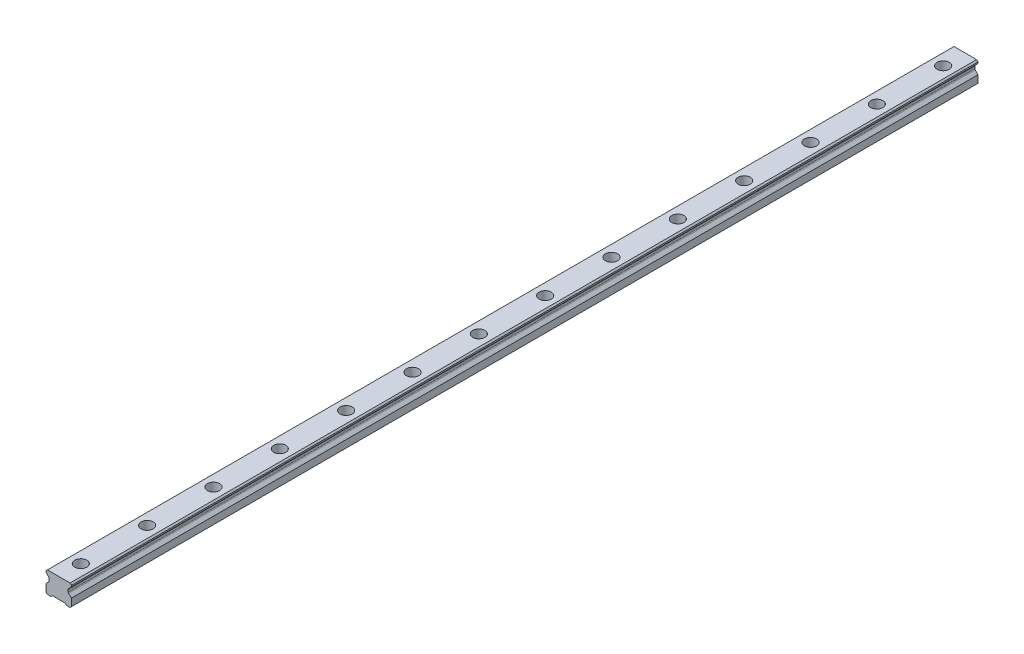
from build123d import *

# Parameters (mm, degrees)
SKETCH1_W           = 23
SKETCH1_H           = 19.2
BOSS_EXTRUDE1_DEPTH = 410
CUT_EXTRUDE1_DEPTH  = 821.305363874
CHAMFER1_SIZE       = 1.25
FILLET1_R           = 1.25
CUT_EXTRUDE2_DEPTH  = 821.305363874
SKETCH4_R           = 5.5
SKETCH4_R_2         = 3.5
CUT_EXTRUDE3_DEPTH  = 9
SKETCH4_2_R         = 3.5
CUT_EXTRUDE4_DEPTH  = 411.610387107
LPATTERN1_COUNT     = 14
LPATTERN1_PITCH     = 60


with BuildPart() as part:
    # Sketch1 → Boss-Extrude1 (new, symmetric)
    with BuildSketch(Plane.XY):
        with Locations((0, 9.6)):
            Rectangle(SKETCH1_W, SKETCH1_H)
    extrude(amount=BOSS_EXTRUDE1_DEPTH, both=True)

    # Sketch2 → Cut-Extrude1 (cut, through all)
    with BuildSketch(Plane.XY.offset(410)):
        Polygon((-11.5, 16.7), (-11.5, 7.95), (-8.583333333, 10.866666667), (-8.583333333, 13.783333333), align=None)
        Polygon((8.583333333, 13.783333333), (11.5, 16.7), (11.5, 7.95), (8.583333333, 10.866666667), align=None)
    extrude(amount=-CUT_EXTRUDE1_DEPTH, mode=Mode.SUBTRACT)

    # Chamfer1
    chamfer1_edges = [part.edges().sort_by_distance(p)[0] for p in [
        (-11.5, 19.2, 0),
        (11.5, 19.2, 0),
        (11.5, 0, 0),
        (-11.5, 0, 0),
    ]]
    chamfer(chamfer1_edges, length=CHAMFER1_SIZE)

    # Fillet1
    fillet1_edges = [part.edges().sort_by_distance(p)[0] for p in [
        (-8.583333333, 13.783333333, 0),
        (-8.583333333, 10.866666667, 0),
        (8.583333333, 10.866666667, 0),
        (8.583333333, 13.783333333, 0),
    ]]
    fillet(fillet1_edges, radius=FILLET1_R)

    # Sketch3 → Cut-Extrude2 (cut, through all)
    with BuildSketch(Plane.XY.offset(410)):
        Polygon((-7, 0), (-5.75, 1.25), (5.75, 1.25), (7, 0), align=None)
    extrude(amount=-CUT_EXTRUDE2_DEPTH, mode=Mode.SUBTRACT)

    # Sketch4 → Cut-Extrude3 (cut)
    with BuildSketch(Plane(origin=(0, 19.2, 0), x_dir=(1, 0, 0), z_dir=(0, 1, 0))):
        with Locations(Location((0, -390, 0), (0, 0, 270))):
            Circle(SKETCH4_R)
        with Locations(Location((0, -390, 0), (0, 0, 270))):
            Circle(SKETCH4_R_2, mode=Mode.SUBTRACT)
    cut_extrude3 = extrude(amount=-CUT_EXTRUDE3_DEPTH, mode=Mode.SUBTRACT)

    # Sketch4_2 → Cut-Extrude4 (cut, through all)
    with BuildSketch(Plane(origin=(0, 19.2, 0), x_dir=(1, 0, 0), z_dir=(0, 1, 0))):
        with Locations(Location((0, -390, 0), (0, 0, 270))):
            Circle(SKETCH4_2_R)
    cut_extrude4 = extrude(amount=-CUT_EXTRUDE4_DEPTH, mode=Mode.SUBTRACT)

    # LPattern1: Cut-Extrude3, Cut-Extrude4 ×14
    with Locations(*[(0, 0, -i * LPATTERN1_PITCH) for i in range(1, LPATTERN1_COUNT)]):
        add(cut_extrude3, mode=Mode.SUBTRACT)
        add(cut_extrude4, mode=Mode.SUBTRACT)


solid = part.part
